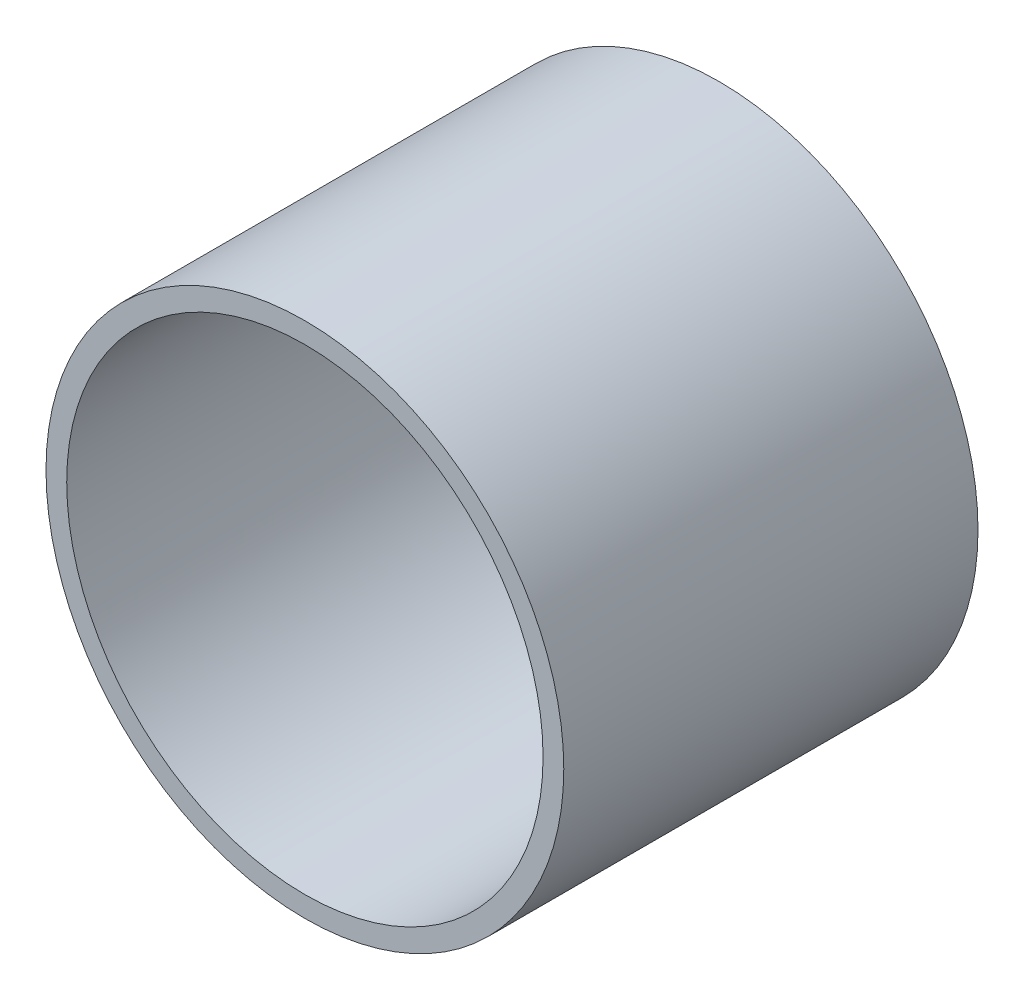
ISO-10303-21;
HEADER;
FILE_DESCRIPTION(('STEP AP214'),'2;1');
FILE_NAME('part.step','',(''),(''),'','','');
FILE_SCHEMA(('AUTOMOTIVE_DESIGN { 1 0 10303 214 1 1 1 1 }'));
ENDSEC;
DATA;
#1=APPLICATION_CONTEXT('core data for automotive mechanical design processes');
#2=APPLICATION_PROTOCOL_DEFINITION('international standard','automotive_design',2000,#1);
#3=PRODUCT_CONTEXT('',#1,'mechanical');
#4=PRODUCT('Part','Part','',(#3));
#5=PRODUCT_RELATED_PRODUCT_CATEGORY('part','',(#4));
#6=PRODUCT_DEFINITION_FORMATION('','',#4);
#7=PRODUCT_DEFINITION_CONTEXT('part definition',#1,'design');
#8=PRODUCT_DEFINITION('design','',#6,#7);
#9=PRODUCT_DEFINITION_SHAPE('','',#8);
#10=(LENGTH_UNIT() NAMED_UNIT(*) SI_UNIT(.MILLI.,.METRE.));
#11=(NAMED_UNIT(*) PLANE_ANGLE_UNIT() SI_UNIT($,.RADIAN.));
#12=(NAMED_UNIT(*) SI_UNIT($,.STERADIAN.) SOLID_ANGLE_UNIT());
#13=UNCERTAINTY_MEASURE_WITH_UNIT(LENGTH_MEASURE(1.E-05),#10,'distance_accuracy_value','');
#14=(GEOMETRIC_REPRESENTATION_CONTEXT(3) GLOBAL_UNCERTAINTY_ASSIGNED_CONTEXT((#13)) GLOBAL_UNIT_ASSIGNED_CONTEXT((#10,
#11,#12)) REPRESENTATION_CONTEXT('',''));
#15=CARTESIAN_POINT('',(0.,0.,0.));
#16=DIRECTION('',(0.,0.,1.));
#17=DIRECTION('',(1.,0.,0.));
#18=AXIS2_PLACEMENT_3D('',#15,#16,#17);
#19=CARTESIAN_POINT('',(0.,0.,6.35));
#20=DIRECTION('',(0.,0.,-1.));
#21=DIRECTION('',(-1.,0.,0.));
#22=AXIS2_PLACEMENT_3D('',#19,#20,#21);
#23=CYLINDRICAL_SURFACE('',#22,3.96875);
#24=CARTESIAN_POINT('',(0.,0.,6.35));
#25=DIRECTION('',(0.,0.,1.));
#26=DIRECTION('',(1.,0.,0.));
#27=AXIS2_PLACEMENT_3D('',#24,#25,#26);
#28=CIRCLE('',#27,3.96875);
#29=CARTESIAN_POINT('',(3.96875,0.,6.35));
#30=VERTEX_POINT('',#29);
#31=EDGE_CURVE('E10',#30,#30,#28,.T.);
#32=ORIENTED_EDGE('',*,*,#31,.F.);
#33=EDGE_LOOP('',(#32));
#34=FACE_BOUND('',#33,.T.);
#35=CARTESIAN_POINT('',(0.,0.,0.));
#36=DIRECTION('',(0.,0.,1.));
#37=DIRECTION('',(1.,0.,0.));
#38=AXIS2_PLACEMENT_3D('',#35,#36,#37);
#39=CIRCLE('',#38,3.96875);
#40=CARTESIAN_POINT('',(3.96875,0.,0.));
#41=VERTEX_POINT('',#40);
#42=EDGE_CURVE('E45',#41,#41,#39,.T.);
#43=ORIENTED_EDGE('',*,*,#42,.T.);
#44=EDGE_LOOP('',(#43));
#45=FACE_BOUND('',#44,.T.);
#46=ADVANCED_FACE('F39',(#34,#45),#23,.T.);
#47=CARTESIAN_POINT('',(0.,0.,6.35));
#48=DIRECTION('',(0.,0.,1.));
#49=DIRECTION('',(1.,0.,0.));
#50=AXIS2_PLACEMENT_3D('',#47,#48,#49);
#51=PLANE('',#50);
#52=CARTESIAN_POINT('',(0.,0.,6.35));
#53=DIRECTION('',(0.,0.,1.));
#54=DIRECTION('',(1.,0.,0.));
#55=AXIS2_PLACEMENT_3D('',#52,#53,#54);
#56=CIRCLE('',#55,3.65125);
#57=CARTESIAN_POINT('',(3.65125,0.,6.35));
#58=VERTEX_POINT('',#57);
#59=EDGE_CURVE('E47',#58,#58,#56,.T.);
#60=ORIENTED_EDGE('',*,*,#59,.F.);
#61=EDGE_LOOP('',(#60));
#62=FACE_BOUND('',#61,.T.);
#63=ORIENTED_EDGE('',*,*,#31,.T.);
#64=EDGE_LOOP('',(#63));
#65=FACE_BOUND('',#64,.T.);
#66=ADVANCED_FACE('F58',(#62,#65),#51,.T.);
#67=CARTESIAN_POINT('',(0.,0.,0.));
#68=DIRECTION('',(0.,0.,1.));
#69=DIRECTION('',(1.,0.,0.));
#70=AXIS2_PLACEMENT_3D('',#67,#68,#69);
#71=PLANE('',#70);
#72=CARTESIAN_POINT('',(0.,0.,0.));
#73=DIRECTION('',(0.,0.,1.));
#74=DIRECTION('',(1.,0.,0.));
#75=AXIS2_PLACEMENT_3D('',#72,#73,#74);
#76=CIRCLE('',#75,3.65125);
#77=CARTESIAN_POINT('',(3.65125,0.,0.));
#78=VERTEX_POINT('',#77);
#79=EDGE_CURVE('E51',#78,#78,#76,.T.);
#80=ORIENTED_EDGE('',*,*,#79,.T.);
#81=EDGE_LOOP('',(#80));
#82=FACE_BOUND('',#81,.T.);
#83=ORIENTED_EDGE('',*,*,#42,.F.);
#84=EDGE_LOOP('',(#83));
#85=FACE_BOUND('',#84,.T.);
#86=ADVANCED_FACE('F61',(#82,#85),#71,.F.);
#87=CARTESIAN_POINT('',(0.,0.,6.35));
#88=DIRECTION('',(0.,0.,-1.));
#89=DIRECTION('',(-1.,0.,0.));
#90=AXIS2_PLACEMENT_3D('',#87,#88,#89);
#91=CYLINDRICAL_SURFACE('',#90,3.65125);
#92=ORIENTED_EDGE('',*,*,#59,.T.);
#93=EDGE_LOOP('',(#92));
#94=FACE_BOUND('',#93,.T.);
#95=ORIENTED_EDGE('',*,*,#79,.F.);
#96=EDGE_LOOP('',(#95));
#97=FACE_BOUND('',#96,.T.);
#98=ADVANCED_FACE('F60',(#94,#97),#91,.F.);
#99=CLOSED_SHELL('',(#46,#66,#86,#98));
#100=MANIFOLD_SOLID_BREP('B2',#99);
#101=ADVANCED_BREP_SHAPE_REPRESENTATION('',(#18,#100),#14);
#102=SHAPE_DEFINITION_REPRESENTATION(#9,#101);
ENDSEC;
END-ISO-10303-21;
